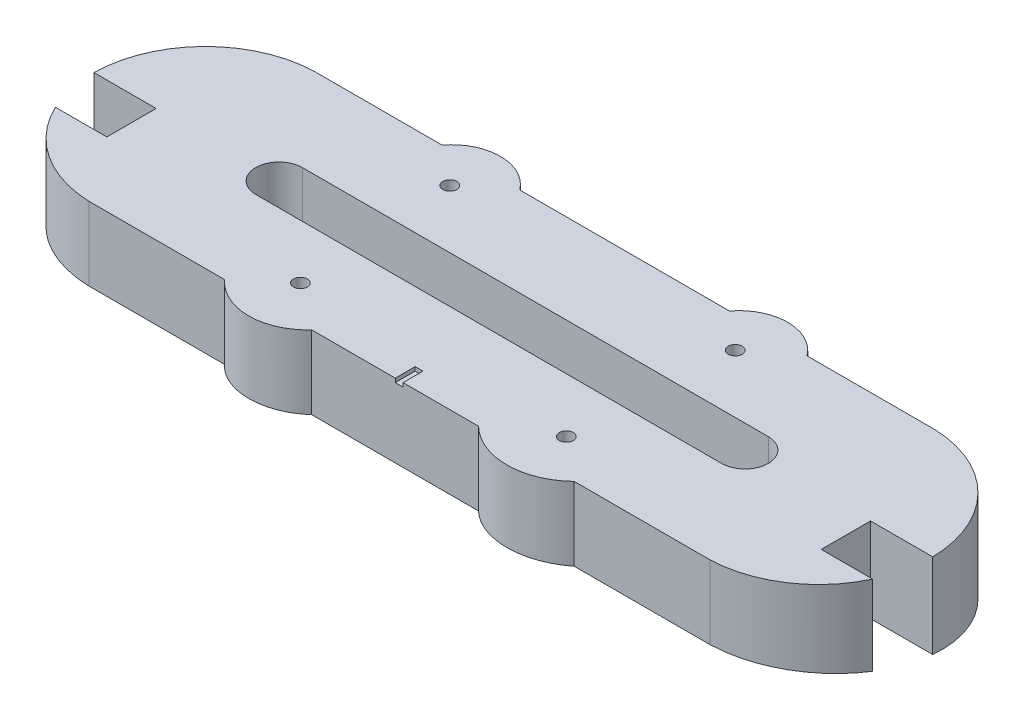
ISO-10303-21;
HEADER;
FILE_DESCRIPTION(('STEP AP214'),'2;1');
FILE_NAME('part.step','',(''),(''),'','','');
FILE_SCHEMA(('AUTOMOTIVE_DESIGN { 1 0 10303 214 1 1 1 1 }'));
ENDSEC;
DATA;
#1=APPLICATION_CONTEXT('core data for automotive mechanical design processes');
#2=APPLICATION_PROTOCOL_DEFINITION('international standard','automotive_design',2000,#1);
#3=PRODUCT_CONTEXT('',#1,'mechanical');
#4=PRODUCT('Part','Part','',(#3));
#5=PRODUCT_RELATED_PRODUCT_CATEGORY('part','',(#4));
#6=PRODUCT_DEFINITION_FORMATION('','',#4);
#7=PRODUCT_DEFINITION_CONTEXT('part definition',#1,'design');
#8=PRODUCT_DEFINITION('design','',#6,#7);
#9=PRODUCT_DEFINITION_SHAPE('','',#8);
#10=(LENGTH_UNIT() NAMED_UNIT(*) SI_UNIT(.MILLI.,.METRE.));
#11=(NAMED_UNIT(*) PLANE_ANGLE_UNIT() SI_UNIT($,.RADIAN.));
#12=(NAMED_UNIT(*) SI_UNIT($,.STERADIAN.) SOLID_ANGLE_UNIT());
#13=UNCERTAINTY_MEASURE_WITH_UNIT(LENGTH_MEASURE(1.E-05),#10,'distance_accuracy_value','');
#14=(GEOMETRIC_REPRESENTATION_CONTEXT(3) GLOBAL_UNCERTAINTY_ASSIGNED_CONTEXT((#13)) GLOBAL_UNIT_ASSIGNED_CONTEXT((#10,
#11,#12)) REPRESENTATION_CONTEXT('',''));
#15=CARTESIAN_POINT('',(0.,0.,0.));
#16=DIRECTION('',(0.,0.,1.));
#17=DIRECTION('',(1.,0.,0.));
#18=AXIS2_PLACEMENT_3D('',#15,#16,#17);
#19=CARTESIAN_POINT('',(0.,12.,0.));
#20=DIRECTION('',(0.,1.,0.));
#21=DIRECTION('',(0.,0.,1.));
#22=AXIS2_PLACEMENT_3D('',#19,#20,#21);
#23=PLANE('',#22);
#24=DIRECTION('',(0.,0.,1.));
#25=VECTOR('',#24,1.);
#26=CARTESIAN_POINT('',(5.70007725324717,12.,19.1306589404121));
#27=LINE('',#26,#25);
#28=CARTESIAN_POINT('',(5.70007725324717,12.,19.1306589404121));
#29=VERTEX_POINT('',#28);
#30=CARTESIAN_POINT('',(5.70007725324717,12.,24.2519083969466));
#31=VERTEX_POINT('',#30);
#32=EDGE_CURVE('E508',#29,#31,#27,.T.);
#33=ORIENTED_EDGE('',*,*,#32,.F.);
#34=DIRECTION('',(-1.,0.,0.));
#35=VECTOR('',#34,1.);
#36=CARTESIAN_POINT('',(5.70007725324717,12.,19.1306589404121));
#37=LINE('',#36,#35);
#38=CARTESIAN_POINT('',(7.70007725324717,12.,19.1306589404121));
#39=VERTEX_POINT('',#38);
#40=EDGE_CURVE('E513',#39,#29,#37,.T.);
#41=ORIENTED_EDGE('',*,*,#40,.F.);
#42=DIRECTION('',(0.,0.,-1.));
#43=VECTOR('',#42,1.);
#44=CARTESIAN_POINT('',(7.70007725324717,12.,19.1306589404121));
#45=LINE('',#44,#43);
#46=CARTESIAN_POINT('',(7.70007725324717,12.,24.2519083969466));
#47=VERTEX_POINT('',#46);
#48=EDGE_CURVE('E528',#47,#39,#45,.T.);
#49=ORIENTED_EDGE('',*,*,#48,.F.);
#50=DIRECTION('',(1.,0.,0.));
#51=VECTOR('',#50,1.);
#52=CARTESIAN_POINT('',(0.,12.,24.2519083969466));
#53=LINE('',#52,#51);
#54=CARTESIAN_POINT('',(27.1374386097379,12.,24.2519083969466));
#55=VERTEX_POINT('',#54);
#56=EDGE_CURVE('E406',#47,#55,#53,.T.);
#57=ORIENTED_EDGE('',*,*,#56,.T.);
#58=CARTESIAN_POINT('',(39.4488719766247,12.,11.5947692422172));
#59=DIRECTION('',(0.,1.,0.));
#60=DIRECTION('',(0.,0.,1.));
#61=AXIS2_PLACEMENT_3D('',#58,#59,#60);
#62=CIRCLE('',#61,17.6571391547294);
#63=CARTESIAN_POINT('',(51.7603053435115,12.,24.2519083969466));
#64=VERTEX_POINT('',#63);
#65=EDGE_CURVE('E402',#64,#55,#62,.F.);
#66=ORIENTED_EDGE('',*,*,#65,.F.);
#67=DIRECTION('',(-1.,0.,0.));
#68=VECTOR('',#67,1.);
#69=CARTESIAN_POINT('',(0.,12.,24.2519083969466));
#70=LINE('',#69,#68);
#71=CARTESIAN_POINT('',(86.7603053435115,12.,24.2519083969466));
#72=VERTEX_POINT('',#71);
#73=EDGE_CURVE('E382',#72,#64,#70,.T.);
#74=ORIENTED_EDGE('',*,*,#73,.F.);
#75=CARTESIAN_POINT('',(85.7424482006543,12.,-4.74809160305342));
#76=DIRECTION('',(0.,1.,0.));
#77=DIRECTION('',(0.,0.,1.));
#78=AXIS2_PLACEMENT_3D('',#75,#76,#77);
#79=CIRCLE('',#78,29.0178571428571);
#80=CARTESIAN_POINT('',(112.001037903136,12.,7.60190839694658));
#81=VERTEX_POINT('',#80);
#82=EDGE_CURVE('E386',#81,#72,#79,.F.);
#83=ORIENTED_EDGE('',*,*,#82,.F.);
#84=DIRECTION('',(1.,0.,0.));
#85=VECTOR('',#84,1.);
#86=CARTESIAN_POINT('',(130.760305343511,12.,7.60190839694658));
#87=LINE('',#86,#85);
#88=CARTESIAN_POINT('',(98.7603053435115,12.,7.60190839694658));
#89=VERTEX_POINT('',#88);
#90=EDGE_CURVE('E442',#89,#81,#87,.T.);
#91=ORIENTED_EDGE('',*,*,#90,.F.);
#92=DIRECTION('',(0.,0.,1.));
#93=VECTOR('',#92,1.);
#94=CARTESIAN_POINT('',(98.7603053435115,12.,-5.09809160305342));
#95=LINE('',#94,#93);
#96=CARTESIAN_POINT('',(98.7603053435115,12.,-5.09809160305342));
#97=VERTEX_POINT('',#96);
#98=EDGE_CURVE('E438',#97,#89,#95,.T.);
#99=ORIENTED_EDGE('',*,*,#98,.F.);
#100=DIRECTION('',(-1.,0.,0.));
#101=VECTOR('',#100,1.);
#102=CARTESIAN_POINT('',(130.760305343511,12.,-5.09809160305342));
#103=LINE('',#102,#101);
#104=CARTESIAN_POINT('',(114.758194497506,12.,-5.09809160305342));
#105=VERTEX_POINT('',#104);
#106=EDGE_CURVE('E433',#105,#97,#103,.T.);
#107=ORIENTED_EDGE('',*,*,#106,.F.);
#108=CARTESIAN_POINT('',(85.7424482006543,12.,-4.74809160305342));
#109=DIRECTION('',(0.,1.,0.));
#110=DIRECTION('',(0.,0.,1.));
#111=AXIS2_PLACEMENT_3D('',#108,#109,#110);
#112=CIRCLE('',#111,29.0178571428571);
#113=CARTESIAN_POINT('',(86.7603053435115,12.,-33.7480916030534));
#114=VERTEX_POINT('',#113);
#115=EDGE_CURVE('E337',#114,#105,#112,.F.);
#116=ORIENTED_EDGE('',*,*,#115,.F.);
#117=DIRECTION('',(1.,0.,0.));
#118=VECTOR('',#117,1.);
#119=CARTESIAN_POINT('',(0.,12.,-33.7480916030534));
#120=LINE('',#119,#118);
#121=CARTESIAN_POINT('',(53.7603053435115,12.,-33.7480916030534));
#122=VERTEX_POINT('',#121);
#123=EDGE_CURVE('E356',#122,#114,#120,.T.);
#124=ORIENTED_EDGE('',*,*,#123,.F.);
#125=CARTESIAN_POINT('',(43.7603053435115,12.,-26.2480916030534));
#126=DIRECTION('',(0.,1.,0.));
#127=DIRECTION('',(0.,0.,1.));
#128=AXIS2_PLACEMENT_3D('',#125,#126,#127);
#129=CIRCLE('',#128,12.5);
#130=CARTESIAN_POINT('',(33.7603053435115,12.,-33.7480916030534));
#131=VERTEX_POINT('',#130);
#132=EDGE_CURVE('E360',#122,#131,#129,.T.);
#133=ORIENTED_EDGE('',*,*,#132,.T.);
#134=DIRECTION('',(-1.,0.,0.));
#135=VECTOR('',#134,1.);
#136=CARTESIAN_POINT('',(0.,12.,-33.7480916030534));
#137=LINE('',#136,#135);
#138=CARTESIAN_POINT('',(-20.2396946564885,12.,-33.7480916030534));
#139=VERTEX_POINT('',#138);
#140=EDGE_CURVE('E585',#131,#139,#137,.T.);
#141=ORIENTED_EDGE('',*,*,#140,.T.);
#142=CARTESIAN_POINT('',(-30.2396946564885,12.,-26.2480916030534));
#143=DIRECTION('',(0.,1.,0.));
#144=DIRECTION('',(0.,0.,1.));
#145=AXIS2_PLACEMENT_3D('',#142,#143,#144);
#146=CIRCLE('',#145,12.5);
#147=CARTESIAN_POINT('',(-40.2396946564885,12.,-33.7480916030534));
#148=VERTEX_POINT('',#147);
#149=EDGE_CURVE('E341',#148,#139,#146,.F.);
#150=ORIENTED_EDGE('',*,*,#149,.F.);
#151=DIRECTION('',(-1.,0.,0.));
#152=VECTOR('',#151,1.);
#153=CARTESIAN_POINT('',(0.,12.,-33.7480916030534));
#154=LINE('',#153,#152);
#155=CARTESIAN_POINT('',(-73.2396946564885,12.,-33.7480916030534));
#156=VERTEX_POINT('',#155);
#157=EDGE_CURVE('E586',#148,#156,#154,.T.);
#158=ORIENTED_EDGE('',*,*,#157,.T.);
#159=CARTESIAN_POINT('',(-72.2218375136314,12.,-4.74809160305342));
#160=DIRECTION('',(0.,1.,0.));
#161=DIRECTION('',(0.,0.,1.));
#162=AXIS2_PLACEMENT_3D('',#159,#160,#161);
#163=CIRCLE('',#162,29.0178571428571);
#164=CARTESIAN_POINT('',(-101.237583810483,12.,-5.0980916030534));
#165=VERTEX_POINT('',#164);
#166=EDGE_CURVE('E575',#156,#165,#163,.T.);
#167=ORIENTED_EDGE('',*,*,#166,.T.);
#168=DIRECTION('',(-1.,0.,0.));
#169=VECTOR('',#168,1.);
#170=CARTESIAN_POINT('',(-117.239694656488,12.,-5.0980916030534));
#171=LINE('',#170,#169);
#172=CARTESIAN_POINT('',(-85.2396946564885,12.,-5.0980916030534));
#173=VERTEX_POINT('',#172);
#174=EDGE_CURVE('E425',#173,#165,#171,.T.);
#175=ORIENTED_EDGE('',*,*,#174,.F.);
#176=DIRECTION('',(0.,0.,-1.));
#177=VECTOR('',#176,1.);
#178=CARTESIAN_POINT('',(-85.2396946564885,12.,-5.0980916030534));
#179=LINE('',#178,#177);
#180=CARTESIAN_POINT('',(-85.2396946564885,12.,7.6019083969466));
#181=VERTEX_POINT('',#180);
#182=EDGE_CURVE('E421',#181,#173,#179,.T.);
#183=ORIENTED_EDGE('',*,*,#182,.F.);
#184=DIRECTION('',(1.,0.,0.));
#185=VECTOR('',#184,1.);
#186=CARTESIAN_POINT('',(-117.239694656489,12.,7.6019083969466));
#187=LINE('',#186,#185);
#188=CARTESIAN_POINT('',(-98.4804272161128,12.,7.6019083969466));
#189=VERTEX_POINT('',#188);
#190=EDGE_CURVE('E415',#189,#181,#187,.T.);
#191=ORIENTED_EDGE('',*,*,#190,.F.);
#192=CARTESIAN_POINT('',(-72.2218375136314,12.,-4.74809160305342));
#193=DIRECTION('',(0.,1.,0.));
#194=DIRECTION('',(0.,0.,1.));
#195=AXIS2_PLACEMENT_3D('',#192,#193,#194);
#196=CIRCLE('',#195,29.0178571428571);
#197=CARTESIAN_POINT('',(-73.2396946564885,12.,24.2519083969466));
#198=VERTEX_POINT('',#197);
#199=EDGE_CURVE('E364',#189,#198,#196,.T.);
#200=ORIENTED_EDGE('',*,*,#199,.T.);
#201=DIRECTION('',(1.,0.,0.));
#202=VECTOR('',#201,1.);
#203=CARTESIAN_POINT('',(0.,12.,24.2519083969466));
#204=LINE('',#203,#202);
#205=CARTESIAN_POINT('',(-38.2396946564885,12.,24.2519083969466));
#206=VERTEX_POINT('',#205);
#207=EDGE_CURVE('E369',#198,#206,#204,.T.);
#208=ORIENTED_EDGE('',*,*,#207,.T.);
#209=CARTESIAN_POINT('',(-27.0511280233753,12.,14.2335060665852));
#210=DIRECTION('',(0.,1.,0.));
#211=DIRECTION('',(0.,0.,1.));
#212=AXIS2_PLACEMENT_3D('',#209,#210,#211);
#213=CIRCLE('',#212,15.0184023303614);
#214=CARTESIAN_POINT('',(-15.8625613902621,12.,24.2519083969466));
#215=VERTEX_POINT('',#214);
#216=EDGE_CURVE('E391',#206,#215,#213,.T.);
#217=ORIENTED_EDGE('',*,*,#216,.T.);
#218=EDGE_CURVE('E407',#215,#31,#53,.T.);
#219=ORIENTED_EDGE('',*,*,#218,.T.);
#220=EDGE_LOOP('',(#33,#41,#49,#57,#66,#74,#83,#91,#99,#107,#116,#124,#133,#141,#150,#158,#167,
#175,#183,#191,#200,#208,#217,#219));
#221=FACE_BOUND('',#220,.T.);
#222=CARTESIAN_POINT('',(-30.2396946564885,12.,-25.7480916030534));
#223=DIRECTION('',(0.,1.,0.));
#224=DIRECTION('',(0.,0.,1.));
#225=AXIS2_PLACEMENT_3D('',#222,#223,#224);
#226=CIRCLE('',#225,1.8);
#227=CARTESIAN_POINT('',(-30.2396946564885,12.,-23.9480916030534));
#228=VERTEX_POINT('',#227);
#229=EDGE_CURVE('E538',#228,#228,#226,.T.);
#230=ORIENTED_EDGE('',*,*,#229,.F.);
#231=EDGE_LOOP('',(#230));
#232=FACE_BOUND('',#231,.T.);
#233=CARTESIAN_POINT('',(43.2603053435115,12.,-25.7480916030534));
#234=DIRECTION('',(0.,1.,0.));
#235=DIRECTION('',(0.,0.,1.));
#236=AXIS2_PLACEMENT_3D('',#233,#234,#235);
#237=CIRCLE('',#236,1.79999999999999);
#238=CARTESIAN_POINT('',(43.2603053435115,12.,-23.9480916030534));
#239=VERTEX_POINT('',#238);
#240=EDGE_CURVE('E551',#239,#239,#237,.T.);
#241=ORIENTED_EDGE('',*,*,#240,.F.);
#242=EDGE_LOOP('',(#241));
#243=FACE_BOUND('',#242,.T.);
#244=CARTESIAN_POINT('',(40.7603053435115,12.,15.2519083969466));
#245=DIRECTION('',(0.,1.,0.));
#246=DIRECTION('',(0.,0.,1.));
#247=AXIS2_PLACEMENT_3D('',#244,#245,#246);
#248=CIRCLE('',#247,1.8);
#249=CARTESIAN_POINT('',(40.7603053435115,12.,17.0519083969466));
#250=VERTEX_POINT('',#249);
#251=EDGE_CURVE('E559',#250,#250,#248,.T.);
#252=ORIENTED_EDGE('',*,*,#251,.F.);
#253=EDGE_LOOP('',(#252));
#254=FACE_BOUND('',#253,.T.);
#255=CARTESIAN_POINT('',(-27.7396946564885,12.,15.2519083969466));
#256=DIRECTION('',(0.,1.,0.));
#257=DIRECTION('',(0.,0.,1.));
#258=AXIS2_PLACEMENT_3D('',#255,#256,#257);
#259=CIRCLE('',#258,1.8);
#260=CARTESIAN_POINT('',(-27.7396946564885,12.,17.0519083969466));
#261=VERTEX_POINT('',#260);
#262=EDGE_CURVE('E567',#261,#261,#259,.T.);
#263=ORIENTED_EDGE('',*,*,#262,.F.);
#264=EDGE_LOOP('',(#263));
#265=FACE_BOUND('',#264,.T.);
#266=CARTESIAN_POINT('',(-53.2396946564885,12.,-4.74809160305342));
#267=DIRECTION('',(0.,1.,0.));
#268=DIRECTION('',(0.,0.,1.));
#269=AXIS2_PLACEMENT_3D('',#266,#267,#268);
#270=CIRCLE('',#269,6.);
#271=CARTESIAN_POINT('',(-53.2396946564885,12.,-10.7480916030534));
#272=VERTEX_POINT('',#271);
#273=CARTESIAN_POINT('',(-53.2396946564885,12.,1.25190839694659));
#274=VERTEX_POINT('',#273);
#275=EDGE_CURVE('E449',#272,#274,#270,.T.);
#276=ORIENTED_EDGE('',*,*,#275,.F.);
#277=DIRECTION('',(-1.,0.,0.));
#278=VECTOR('',#277,1.);
#279=CARTESIAN_POINT('',(-53.2396946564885,12.,-10.7480916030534));
#280=LINE('',#279,#278);
#281=CARTESIAN_POINT('',(66.7603053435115,12.,-10.7480916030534));
#282=VERTEX_POINT('',#281);
#283=EDGE_CURVE('E463',#282,#272,#280,.T.);
#284=ORIENTED_EDGE('',*,*,#283,.F.);
#285=CARTESIAN_POINT('',(66.7603053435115,12.,-4.74809160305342));
#286=DIRECTION('',(0.,1.,0.));
#287=DIRECTION('',(0.,0.,1.));
#288=AXIS2_PLACEMENT_3D('',#285,#286,#287);
#289=CIRCLE('',#288,6.);
#290=CARTESIAN_POINT('',(66.7603053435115,12.,1.25190839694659));
#291=VERTEX_POINT('',#290);
#292=EDGE_CURVE('E459',#291,#282,#289,.T.);
#293=ORIENTED_EDGE('',*,*,#292,.F.);
#294=DIRECTION('',(1.,0.,0.));
#295=VECTOR('',#294,1.);
#296=CARTESIAN_POINT('',(-53.2396946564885,12.,1.25190839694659));
#297=LINE('',#296,#295);
#298=EDGE_CURVE('E455',#274,#291,#297,.T.);
#299=ORIENTED_EDGE('',*,*,#298,.F.);
#300=EDGE_LOOP('',(#276,#284,#293,#299));
#301=FACE_BOUND('',#300,.T.);
#302=ADVANCED_FACE('F129',(#221,#232,#243,#254,#265,#301),#23,.T.);
#303=CARTESIAN_POINT('',(-117.239694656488,0.,-5.0980916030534));
#304=DIRECTION('',(0.,0.,-1.));
#305=DIRECTION('',(-1.,0.,0.));
#306=AXIS2_PLACEMENT_3D('',#303,#304,#305);
#307=PLANE('',#306);
#308=DIRECTION('',(0.,1.,0.));
#309=VECTOR('',#308,1.);
#310=CARTESIAN_POINT('',(-101.237583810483,0.,-5.0980916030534));
#311=LINE('',#310,#309);
#312=CARTESIAN_POINT('',(-101.237583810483,-9.80774603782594,-5.09809160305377));
#313=VERTEX_POINT('',#312);
#314=EDGE_CURVE('E581',#313,#165,#311,.T.);
#315=ORIENTED_EDGE('',*,*,#314,.F.);
#316=DIRECTION('',(1.,0.,0.));
#317=VECTOR('',#316,1.);
#318=CARTESIAN_POINT('',(-117.239694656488,-9.80774603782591,-5.0980916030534));
#319=LINE('',#318,#317);
#320=CARTESIAN_POINT('',(-85.2396946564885,-9.80774603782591,-5.0980916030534));
#321=VERTEX_POINT('',#320);
#322=EDGE_CURVE('E691',#313,#321,#319,.T.);
#323=ORIENTED_EDGE('',*,*,#322,.T.);
#324=DIRECTION('',(0.,1.,0.));
#325=VECTOR('',#324,1.);
#326=CARTESIAN_POINT('',(-85.2396946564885,0.,-5.0980916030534));
#327=LINE('',#326,#325);
#328=EDGE_CURVE('E430',#321,#173,#327,.T.);
#329=ORIENTED_EDGE('',*,*,#328,.T.);
#330=ORIENTED_EDGE('',*,*,#174,.T.);
#331=EDGE_LOOP('',(#315,#323,#329,#330));
#332=FACE_BOUND('',#331,.T.);
#333=ADVANCED_FACE('F728',(#332),#307,.F.);
#334=CARTESIAN_POINT('',(-117.239694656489,0.,7.6019083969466));
#335=DIRECTION('',(0.,0.,1.));
#336=DIRECTION('',(1.,0.,0.));
#337=AXIS2_PLACEMENT_3D('',#334,#335,#336);
#338=PLANE('',#337);
#339=DIRECTION('',(0.,1.,0.));
#340=VECTOR('',#339,1.);
#341=CARTESIAN_POINT('',(-85.2396946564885,0.,7.6019083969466));
#342=LINE('',#341,#340);
#343=CARTESIAN_POINT('',(-85.2396946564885,-8.55802424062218,7.60190839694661));
#344=VERTEX_POINT('',#343);
#345=EDGE_CURVE('E429',#344,#181,#342,.T.);
#346=ORIENTED_EDGE('',*,*,#345,.F.);
#347=DIRECTION('',(-1.,0.,0.));
#348=VECTOR('',#347,1.);
#349=CARTESIAN_POINT('',(-117.239694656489,-8.55802424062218,7.6019083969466));
#350=LINE('',#349,#348);
#351=CARTESIAN_POINT('',(-98.4804272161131,-8.55802424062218,7.6019083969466));
#352=VERTEX_POINT('',#351);
#353=EDGE_CURVE('E678',#344,#352,#350,.T.);
#354=ORIENTED_EDGE('',*,*,#353,.T.);
#355=DIRECTION('',(0.,1.,0.));
#356=VECTOR('',#355,1.);
#357=CARTESIAN_POINT('',(-98.4804272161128,0.,7.6019083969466));
#358=LINE('',#357,#356);
#359=EDGE_CURVE('E368',#352,#189,#358,.T.);
#360=ORIENTED_EDGE('',*,*,#359,.T.);
#361=ORIENTED_EDGE('',*,*,#190,.T.);
#362=EDGE_LOOP('',(#346,#354,#360,#361));
#363=FACE_BOUND('',#362,.T.);
#364=ADVANCED_FACE('F732',(#363),#338,.F.);
#365=CARTESIAN_POINT('',(-53.2396946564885,0.,-4.74809160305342));
#366=DIRECTION('',(0.,1.,0.));
#367=DIRECTION('',(0.,0.,1.));
#368=AXIS2_PLACEMENT_3D('',#365,#366,#367);
#369=CYLINDRICAL_SURFACE('',#368,6.);
#370=DIRECTION('',(0.,1.,0.));
#371=VECTOR('',#370,1.);
#372=CARTESIAN_POINT('',(-53.2396946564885,0.,1.25190839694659));
#373=LINE('',#372,#371);
#374=CARTESIAN_POINT('',(-53.2396946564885,-9.18288513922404,1.25190839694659));
#375=VERTEX_POINT('',#374);
#376=EDGE_CURVE('E467',#375,#274,#373,.T.);
#377=ORIENTED_EDGE('',*,*,#376,.F.);
#378=CARTESIAN_POINT('',(-53.2396946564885,-9.77330488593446,-4.74809160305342));
#379=DIRECTION('',(0.,0.995193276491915,-0.0979302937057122));
#380=DIRECTION('',(0.,0.0979302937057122,0.995193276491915));
#381=AXIS2_PLACEMENT_3D('',#378,#379,#380);
#382=ELLIPSE('',#381,6.0289796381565,6.);
#383=CARTESIAN_POINT('',(-53.2396946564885,-10.3637246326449,-10.7480916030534));
#384=VERTEX_POINT('',#383);
#385=EDGE_CURVE('E144',#375,#384,#382,.F.);
#386=ORIENTED_EDGE('',*,*,#385,.T.);
#387=DIRECTION('',(0.,1.,0.));
#388=VECTOR('',#387,1.);
#389=CARTESIAN_POINT('',(-53.2396946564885,0.,-10.7480916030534));
#390=LINE('',#389,#388);
#391=EDGE_CURVE('E137',#384,#272,#390,.T.);
#392=ORIENTED_EDGE('',*,*,#391,.T.);
#393=ORIENTED_EDGE('',*,*,#275,.T.);
#394=EDGE_LOOP('',(#377,#386,#392,#393));
#395=FACE_BOUND('',#394,.T.);
#396=ADVANCED_FACE('F485',(#395),#369,.F.);
#397=CARTESIAN_POINT('',(-53.2396946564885,0.,-10.7480916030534));
#398=DIRECTION('',(0.,0.,-1.));
#399=DIRECTION('',(-1.,0.,0.));
#400=AXIS2_PLACEMENT_3D('',#397,#398,#399);
#401=PLANE('',#400);
#402=ORIENTED_EDGE('',*,*,#391,.F.);
#403=DIRECTION('',(1.,0.,0.));
#404=VECTOR('',#403,1.);
#405=CARTESIAN_POINT('',(-53.2396946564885,-10.3637246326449,-10.7480916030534));
#406=LINE('',#405,#404);
#407=CARTESIAN_POINT('',(66.7603053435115,-10.3637246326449,-10.7480916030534));
#408=VERTEX_POINT('',#407);
#409=EDGE_CURVE('E496',#384,#408,#406,.T.);
#410=ORIENTED_EDGE('',*,*,#409,.T.);
#411=DIRECTION('',(0.,1.,0.));
#412=VECTOR('',#411,1.);
#413=CARTESIAN_POINT('',(66.7603053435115,0.,-10.7480916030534));
#414=LINE('',#413,#412);
#415=EDGE_CURVE('E470',#408,#282,#414,.T.);
#416=ORIENTED_EDGE('',*,*,#415,.T.);
#417=ORIENTED_EDGE('',*,*,#283,.T.);
#418=EDGE_LOOP('',(#402,#410,#416,#417));
#419=FACE_BOUND('',#418,.T.);
#420=ADVANCED_FACE('F752',(#419),#401,.F.);
#421=CARTESIAN_POINT('',(66.7603053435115,0.,-4.74809160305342));
#422=DIRECTION('',(0.,1.,0.));
#423=DIRECTION('',(0.,0.,1.));
#424=AXIS2_PLACEMENT_3D('',#421,#422,#423);
#425=CYLINDRICAL_SURFACE('',#424,6.);
#426=ORIENTED_EDGE('',*,*,#415,.F.);
#427=CARTESIAN_POINT('',(66.7603053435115,-9.77330488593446,-4.74809160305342));
#428=DIRECTION('',(0.,0.995193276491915,-0.0979302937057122));
#429=DIRECTION('',(0.,0.0979302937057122,0.995193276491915));
#430=AXIS2_PLACEMENT_3D('',#427,#428,#429);
#431=ELLIPSE('',#430,6.0289796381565,6.);
#432=CARTESIAN_POINT('',(66.7603053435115,-9.18288513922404,1.25190839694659));
#433=VERTEX_POINT('',#432);
#434=EDGE_CURVE('E493',#408,#433,#431,.F.);
#435=ORIENTED_EDGE('',*,*,#434,.T.);
#436=DIRECTION('',(0.,1.,0.));
#437=VECTOR('',#436,1.);
#438=CARTESIAN_POINT('',(66.7603053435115,0.,1.25190839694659));
#439=LINE('',#438,#437);
#440=EDGE_CURVE('E473',#433,#291,#439,.T.);
#441=ORIENTED_EDGE('',*,*,#440,.T.);
#442=ORIENTED_EDGE('',*,*,#292,.T.);
#443=EDGE_LOOP('',(#426,#435,#441,#442));
#444=FACE_BOUND('',#443,.T.);
#445=ADVANCED_FACE('F491',(#444),#425,.F.);
#446=CARTESIAN_POINT('',(-53.2396946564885,0.,1.25190839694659));
#447=DIRECTION('',(0.,0.,1.));
#448=DIRECTION('',(1.,0.,0.));
#449=AXIS2_PLACEMENT_3D('',#446,#447,#448);
#450=PLANE('',#449);
#451=ORIENTED_EDGE('',*,*,#440,.F.);
#452=DIRECTION('',(-1.,0.,0.));
#453=VECTOR('',#452,1.);
#454=CARTESIAN_POINT('',(-53.2396946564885,-9.18288513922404,1.25190839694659));
#455=LINE('',#454,#453);
#456=EDGE_CURVE('E482',#433,#375,#455,.T.);
#457=ORIENTED_EDGE('',*,*,#456,.T.);
#458=ORIENTED_EDGE('',*,*,#376,.T.);
#459=ORIENTED_EDGE('',*,*,#298,.T.);
#460=EDGE_LOOP('',(#451,#457,#458,#459));
#461=FACE_BOUND('',#460,.T.);
#462=ADVANCED_FACE('F479',(#461),#450,.F.);
#463=CARTESIAN_POINT('',(130.760305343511,0.,7.60190839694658));
#464=DIRECTION('',(0.,0.,1.));
#465=DIRECTION('',(1.,0.,0.));
#466=AXIS2_PLACEMENT_3D('',#463,#464,#465);
#467=PLANE('',#466);
#468=DIRECTION('',(0.,1.,0.));
#469=VECTOR('',#468,1.);
#470=CARTESIAN_POINT('',(112.001037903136,0.,7.60190839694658));
#471=LINE('',#470,#469);
#472=CARTESIAN_POINT('',(112.001037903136,-8.55802424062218,7.60190839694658));
#473=VERTEX_POINT('',#472);
#474=EDGE_CURVE('E387',#473,#81,#471,.T.);
#475=ORIENTED_EDGE('',*,*,#474,.F.);
#476=DIRECTION('',(-1.,0.,0.));
#477=VECTOR('',#476,1.);
#478=CARTESIAN_POINT('',(130.760305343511,-8.55802424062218,7.60190839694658));
#479=LINE('',#478,#477);
#480=CARTESIAN_POINT('',(98.7603053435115,-8.55802424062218,7.60190839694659));
#481=VERTEX_POINT('',#480);
#482=EDGE_CURVE('E625',#473,#481,#479,.T.);
#483=ORIENTED_EDGE('',*,*,#482,.T.);
#484=DIRECTION('',(0.,1.,0.));
#485=VECTOR('',#484,1.);
#486=CARTESIAN_POINT('',(98.7603053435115,0.,7.60190839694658));
#487=LINE('',#486,#485);
#488=EDGE_CURVE('E446',#481,#89,#487,.T.);
#489=ORIENTED_EDGE('',*,*,#488,.T.);
#490=ORIENTED_EDGE('',*,*,#90,.T.);
#491=EDGE_LOOP('',(#475,#483,#489,#490));
#492=FACE_BOUND('',#491,.T.);
#493=ADVANCED_FACE('F714',(#492),#467,.F.);
#494=CARTESIAN_POINT('',(130.760305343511,0.,-5.09809160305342));
#495=DIRECTION('',(0.,0.,-1.));
#496=DIRECTION('',(-1.,0.,0.));
#497=AXIS2_PLACEMENT_3D('',#494,#495,#496);
#498=PLANE('',#497);
#499=DIRECTION('',(0.,1.,0.));
#500=VECTOR('',#499,1.);
#501=CARTESIAN_POINT('',(98.7603053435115,0.,-5.09809160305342));
#502=LINE('',#501,#500);
#503=CARTESIAN_POINT('',(98.7603053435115,-9.80774603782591,-5.09809160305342));
#504=VERTEX_POINT('',#503);
#505=EDGE_CURVE('E331',#504,#97,#502,.T.);
#506=ORIENTED_EDGE('',*,*,#505,.F.);
#507=DIRECTION('',(1.,0.,0.));
#508=VECTOR('',#507,1.);
#509=CARTESIAN_POINT('',(130.760305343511,-9.80774603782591,-5.09809160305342));
#510=LINE('',#509,#508);
#511=CARTESIAN_POINT('',(114.758194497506,-9.80774603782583,-5.09809160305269));
#512=VERTEX_POINT('',#511);
#513=EDGE_CURVE('E315',#504,#512,#510,.T.);
#514=ORIENTED_EDGE('',*,*,#513,.T.);
#515=DIRECTION('',(0.,1.,0.));
#516=VECTOR('',#515,1.);
#517=CARTESIAN_POINT('',(114.758194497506,0.,-5.09809160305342));
#518=LINE('',#517,#516);
#519=EDGE_CURVE('E329',#512,#105,#518,.T.);
#520=ORIENTED_EDGE('',*,*,#519,.T.);
#521=ORIENTED_EDGE('',*,*,#106,.T.);
#522=EDGE_LOOP('',(#506,#514,#520,#521));
#523=FACE_BOUND('',#522,.T.);
#524=ADVANCED_FACE('F327',(#523),#498,.F.);
#525=CARTESIAN_POINT('',(98.7603053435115,0.,-5.09809160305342));
#526=DIRECTION('',(-1.,0.,0.));
#527=DIRECTION('',(0.,0.,1.));
#528=AXIS2_PLACEMENT_3D('',#525,#526,#527);
#529=PLANE('',#528);
#530=ORIENTED_EDGE('',*,*,#488,.F.);
#531=DIRECTION('',(0.,-0.0979302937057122,-0.995193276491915));
#532=VECTOR('',#531,1.);
#533=CARTESIAN_POINT('',(98.7603053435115,-9.7136863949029,-4.14223289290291));
#534=LINE('',#533,#532);
#535=EDGE_CURVE('E622',#481,#504,#534,.T.);
#536=ORIENTED_EDGE('',*,*,#535,.T.);
#537=ORIENTED_EDGE('',*,*,#505,.T.);
#538=ORIENTED_EDGE('',*,*,#98,.T.);
#539=EDGE_LOOP('',(#530,#536,#537,#538));
#540=FACE_BOUND('',#539,.T.);
#541=ADVANCED_FACE('F621',(#540),#529,.F.);
#542=CARTESIAN_POINT('',(-85.2396946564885,0.,-5.0980916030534));
#543=DIRECTION('',(1.,0.,0.));
#544=DIRECTION('',(0.,0.,-1.));
#545=AXIS2_PLACEMENT_3D('',#542,#543,#544);
#546=PLANE('',#545);
#547=ORIENTED_EDGE('',*,*,#328,.F.);
#548=DIRECTION('',(0.,0.0979302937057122,0.995193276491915));
#549=VECTOR('',#548,1.);
#550=CARTESIAN_POINT('',(-85.2396946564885,-9.7136863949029,-4.14223289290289));
#551=LINE('',#550,#549);
#552=EDGE_CURVE('E680',#321,#344,#551,.T.);
#553=ORIENTED_EDGE('',*,*,#552,.T.);
#554=ORIENTED_EDGE('',*,*,#345,.T.);
#555=ORIENTED_EDGE('',*,*,#182,.T.);
#556=EDGE_LOOP('',(#547,#553,#554,#555));
#557=FACE_BOUND('',#556,.T.);
#558=ADVANCED_FACE('F725',(#557),#546,.F.);
#559=CARTESIAN_POINT('',(-27.0511280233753,0.,14.2335060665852));
#560=DIRECTION('',(0.,1.,0.));
#561=DIRECTION('',(0.,0.,1.));
#562=AXIS2_PLACEMENT_3D('',#559,#560,#561);
#563=CYLINDRICAL_SURFACE('',#562,15.0184023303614);
#564=DIRECTION('',(0.,1.,0.));
#565=VECTOR('',#564,1.);
#566=CARTESIAN_POINT('',(-38.2396946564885,0.,24.2519083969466));
#567=LINE('',#566,#565);
#568=CARTESIAN_POINT('',(-38.2396946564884,-6.91960944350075,24.2519083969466));
#569=VERTEX_POINT('',#568);
#570=EDGE_CURVE('E376',#569,#206,#567,.T.);
#571=ORIENTED_EDGE('',*,*,#570,.F.);
#572=CARTESIAN_POINT('',(-27.0511280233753,-7.9054532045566,14.2335060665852));
#573=DIRECTION('',(0.,0.995193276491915,-0.0979302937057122));
#574=DIRECTION('',(0.,0.0979302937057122,0.995193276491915));
#575=AXIS2_PLACEMENT_3D('',#572,#573,#574);
#576=ELLIPSE('',#575,15.0909403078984,15.0184023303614);
#577=CARTESIAN_POINT('',(-15.8625613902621,-6.91960944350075,24.2519083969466));
#578=VERTEX_POINT('',#577);
#579=EDGE_CURVE('E633',#578,#569,#576,.F.);
#580=ORIENTED_EDGE('',*,*,#579,.F.);
#581=DIRECTION('',(0.,1.,0.));
#582=VECTOR('',#581,1.);
#583=CARTESIAN_POINT('',(-15.8625613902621,0.,24.2519083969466));
#584=LINE('',#583,#582);
#585=EDGE_CURVE('E412',#578,#215,#584,.T.);
#586=ORIENTED_EDGE('',*,*,#585,.T.);
#587=ORIENTED_EDGE('',*,*,#216,.F.);
#588=EDGE_LOOP('',(#571,#580,#586,#587));
#589=FACE_BOUND('',#588,.T.);
#590=ADVANCED_FACE('F655',(#589),#563,.T.);
#591=CARTESIAN_POINT('',(0.,0.,24.2519083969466));
#592=DIRECTION('',(0.,0.,1.));
#593=DIRECTION('',(1.,0.,0.));
#594=AXIS2_PLACEMENT_3D('',#591,#592,#593);
#595=PLANE('',#594);
#596=DIRECTION('',(-1.,0.,0.));
#597=VECTOR('',#596,1.);
#598=CARTESIAN_POINT('',(0.,-6.91960944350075,24.2519083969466));
#599=LINE('',#598,#597);
#600=CARTESIAN_POINT('',(27.1374386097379,-6.91960944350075,24.2519083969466));
#601=VERTEX_POINT('',#600);
#602=EDGE_CURVE('E502',#601,#578,#599,.T.);
#603=ORIENTED_EDGE('',*,*,#602,.F.);
#604=DIRECTION('',(0.,1.,0.));
#605=VECTOR('',#604,1.);
#606=CARTESIAN_POINT('',(27.1374386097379,0.,24.2519083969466));
#607=LINE('',#606,#605);
#608=EDGE_CURVE('E411',#601,#55,#607,.T.);
#609=ORIENTED_EDGE('',*,*,#608,.T.);
#610=ORIENTED_EDGE('',*,*,#56,.F.);
#611=DIRECTION('',(0.,1.,0.));
#612=VECTOR('',#611,1.);
#613=CARTESIAN_POINT('',(7.70007725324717,11.,24.2519083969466));
#614=LINE('',#613,#612);
#615=CARTESIAN_POINT('',(7.70007725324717,11.,24.2519083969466));
#616=VERTEX_POINT('',#615);
#617=EDGE_CURVE('E542',#616,#47,#614,.T.);
#618=ORIENTED_EDGE('',*,*,#617,.F.);
#619=DIRECTION('',(1.,0.,0.));
#620=VECTOR('',#619,1.);
#621=CARTESIAN_POINT('',(5.70007725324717,11.,24.2519083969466));
#622=LINE('',#621,#620);
#623=CARTESIAN_POINT('',(5.70007725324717,11.,24.2519083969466));
#624=VERTEX_POINT('',#623);
#625=EDGE_CURVE('E512',#624,#616,#622,.T.);
#626=ORIENTED_EDGE('',*,*,#625,.F.);
#627=DIRECTION('',(0.,1.,0.));
#628=VECTOR('',#627,1.);
#629=CARTESIAN_POINT('',(5.70007725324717,11.,24.2519083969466));
#630=LINE('',#629,#628);
#631=EDGE_CURVE('E525',#624,#31,#630,.T.);
#632=ORIENTED_EDGE('',*,*,#631,.T.);
#633=ORIENTED_EDGE('',*,*,#218,.F.);
#634=ORIENTED_EDGE('',*,*,#585,.F.);
#635=EDGE_LOOP('',(#603,#609,#610,#618,#626,#632,#633,#634));
#636=FACE_BOUND('',#635,.T.);
#637=ADVANCED_FACE('F659',(#636),#595,.T.);
#638=CARTESIAN_POINT('',(39.4488719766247,0.,11.5947692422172));
#639=DIRECTION('',(0.,1.,0.));
#640=DIRECTION('',(0.,0.,1.));
#641=AXIS2_PLACEMENT_3D('',#638,#639,#640);
#642=CYLINDRICAL_SURFACE('',#641,17.6571391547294);
#643=CARTESIAN_POINT('',(39.4488719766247,-8.16511359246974,11.5947692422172));
#644=DIRECTION('',(0.,0.995193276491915,-0.0979302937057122));
#645=DIRECTION('',(0.,0.0979302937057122,0.995193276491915));
#646=AXIS2_PLACEMENT_3D('',#643,#644,#645);
#647=ELLIPSE('',#646,17.7424220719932,17.6571391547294);
#648=CARTESIAN_POINT('',(51.7603053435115,-6.91960944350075,24.2519083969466));
#649=VERTEX_POINT('',#648);
#650=EDGE_CURVE('E642',#601,#649,#647,.T.);
#651=ORIENTED_EDGE('',*,*,#650,.T.);
#652=DIRECTION('',(0.,1.,0.));
#653=VECTOR('',#652,1.);
#654=CARTESIAN_POINT('',(51.7603053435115,0.,24.2519083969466));
#655=LINE('',#654,#653);
#656=EDGE_CURVE('E379',#649,#64,#655,.T.);
#657=ORIENTED_EDGE('',*,*,#656,.T.);
#658=ORIENTED_EDGE('',*,*,#65,.T.);
#659=ORIENTED_EDGE('',*,*,#608,.F.);
#660=EDGE_LOOP('',(#651,#657,#658,#659));
#661=FACE_BOUND('',#660,.T.);
#662=ADVANCED_FACE('F706',(#661),#642,.T.);
#663=CARTESIAN_POINT('',(0.,0.,24.2519083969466));
#664=DIRECTION('',(0.,0.,-1.));
#665=DIRECTION('',(-1.,0.,0.));
#666=AXIS2_PLACEMENT_3D('',#663,#664,#665);
#667=PLANE('',#666);
#668=ORIENTED_EDGE('',*,*,#656,.F.);
#669=DIRECTION('',(1.,0.,0.));
#670=VECTOR('',#669,1.);
#671=CARTESIAN_POINT('',(0.,-6.91960944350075,24.2519083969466));
#672=LINE('',#671,#670);
#673=CARTESIAN_POINT('',(86.7603053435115,-6.91960944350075,24.2519083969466));
#674=VERTEX_POINT('',#673);
#675=EDGE_CURVE('E638',#649,#674,#672,.T.);
#676=ORIENTED_EDGE('',*,*,#675,.T.);
#677=DIRECTION('',(0.,1.,0.));
#678=VECTOR('',#677,1.);
#679=CARTESIAN_POINT('',(86.7603053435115,0.,24.2519083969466));
#680=LINE('',#679,#678);
#681=EDGE_CURVE('E392',#674,#72,#680,.T.);
#682=ORIENTED_EDGE('',*,*,#681,.T.);
#683=ORIENTED_EDGE('',*,*,#73,.T.);
#684=EDGE_LOOP('',(#668,#676,#682,#683));
#685=FACE_BOUND('',#684,.T.);
#686=ADVANCED_FACE('F709',(#685),#667,.F.);
#687=CARTESIAN_POINT('',(85.7424482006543,0.,-4.74809160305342));
#688=DIRECTION('',(0.,1.,0.));
#689=DIRECTION('',(0.,0.,1.));
#690=AXIS2_PLACEMENT_3D('',#687,#688,#689);
#691=CYLINDRICAL_SURFACE('',#690,29.0178571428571);
#692=ORIENTED_EDGE('',*,*,#681,.F.);
#693=CARTESIAN_POINT('',(85.7424482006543,-9.77330488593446,-4.74809160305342));
#694=DIRECTION('',(0.,0.995193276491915,-0.0979302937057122));
#695=DIRECTION('',(0.,0.0979302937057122,0.995193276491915));
#696=AXIS2_PLACEMENT_3D('',#693,#694,#695);
#697=ELLIPSE('',#696,29.1580116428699,29.0178571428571);
#698=EDGE_CURVE('E628',#674,#473,#697,.T.);
#699=ORIENTED_EDGE('',*,*,#698,.T.);
#700=ORIENTED_EDGE('',*,*,#474,.T.);
#701=ORIENTED_EDGE('',*,*,#82,.T.);
#702=EDGE_LOOP('',(#692,#699,#700,#701));
#703=FACE_BOUND('',#702,.T.);
#704=ADVANCED_FACE('F715',(#703),#691,.T.);
#705=CARTESIAN_POINT('',(-72.2218375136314,0.,-4.74809160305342));
#706=DIRECTION('',(0.,1.,0.));
#707=DIRECTION('',(0.,0.,1.));
#708=AXIS2_PLACEMENT_3D('',#705,#706,#707);
#709=CYLINDRICAL_SURFACE('',#708,29.0178571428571);
#710=CARTESIAN_POINT('',(-72.2218375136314,-9.77330488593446,-4.74809160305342));
#711=DIRECTION('',(0.,0.995193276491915,-0.0979302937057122));
#712=DIRECTION('',(0.,0.0979302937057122,0.995193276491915));
#713=AXIS2_PLACEMENT_3D('',#710,#711,#712);
#714=ELLIPSE('',#713,29.1580116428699,29.0178571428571);
#715=CARTESIAN_POINT('',(-73.2396946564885,-6.91960944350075,24.2519083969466));
#716=VERTEX_POINT('',#715);
#717=EDGE_CURVE('E323',#716,#352,#714,.F.);
#718=ORIENTED_EDGE('',*,*,#717,.F.);
#719=DIRECTION('',(0.,1.,0.));
#720=VECTOR('',#719,1.);
#721=CARTESIAN_POINT('',(-73.2396946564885,0.,24.2519083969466));
#722=LINE('',#721,#720);
#723=EDGE_CURVE('E373',#716,#198,#722,.T.);
#724=ORIENTED_EDGE('',*,*,#723,.T.);
#725=ORIENTED_EDGE('',*,*,#199,.F.);
#726=ORIENTED_EDGE('',*,*,#359,.F.);
#727=EDGE_LOOP('',(#718,#724,#725,#726));
#728=FACE_BOUND('',#727,.T.);
#729=ADVANCED_FACE('F672',(#728),#709,.T.);
#730=CARTESIAN_POINT('',(0.,0.,24.2519083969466));
#731=DIRECTION('',(0.,0.,1.));
#732=DIRECTION('',(1.,0.,0.));
#733=AXIS2_PLACEMENT_3D('',#730,#731,#732);
#734=PLANE('',#733);
#735=DIRECTION('',(-1.,0.,0.));
#736=VECTOR('',#735,1.);
#737=CARTESIAN_POINT('',(0.,-6.91960944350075,24.2519083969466));
#738=LINE('',#737,#736);
#739=EDGE_CURVE('E333',#569,#716,#738,.T.);
#740=ORIENTED_EDGE('',*,*,#739,.F.);
#741=ORIENTED_EDGE('',*,*,#570,.T.);
#742=ORIENTED_EDGE('',*,*,#207,.F.);
#743=ORIENTED_EDGE('',*,*,#723,.F.);
#744=EDGE_LOOP('',(#740,#741,#742,#743));
#745=FACE_BOUND('',#744,.T.);
#746=ADVANCED_FACE('F667',(#745),#734,.T.);
#747=CARTESIAN_POINT('',(43.7603053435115,0.,-26.2480916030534));
#748=DIRECTION('',(0.,1.,0.));
#749=DIRECTION('',(0.,0.,1.));
#750=AXIS2_PLACEMENT_3D('',#747,#748,#749);
#751=CYLINDRICAL_SURFACE('',#750,12.5);
#752=DIRECTION('',(0.,1.,0.));
#753=VECTOR('',#752,1.);
#754=CARTESIAN_POINT('',(53.7603053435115,0.,-33.7480916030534));
#755=LINE('',#754,#753);
#756=CARTESIAN_POINT('',(53.7603053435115,-12.6270003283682,-33.7480916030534));
#757=VERTEX_POINT('',#756);
#758=EDGE_CURVE('E346',#757,#122,#755,.T.);
#759=ORIENTED_EDGE('',*,*,#758,.F.);
#760=CARTESIAN_POINT('',(43.7603053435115,-11.8889756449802,-26.2480916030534));
#761=DIRECTION('',(0.,0.995193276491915,-0.0979302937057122));
#762=DIRECTION('',(0.,0.0979302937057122,0.995193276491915));
#763=AXIS2_PLACEMENT_3D('',#760,#761,#762);
#764=ELLIPSE('',#763,12.5603742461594,12.5);
#765=CARTESIAN_POINT('',(33.7603053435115,-12.6270003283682,-33.7480916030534));
#766=VERTEX_POINT('',#765);
#767=EDGE_CURVE('E684',#766,#757,#764,.F.);
#768=ORIENTED_EDGE('',*,*,#767,.F.);
#769=DIRECTION('',(0.,1.,0.));
#770=VECTOR('',#769,1.);
#771=CARTESIAN_POINT('',(33.7603053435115,0.,-33.7480916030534));
#772=LINE('',#771,#770);
#773=EDGE_CURVE('E597',#766,#131,#772,.T.);
#774=ORIENTED_EDGE('',*,*,#773,.T.);
#775=ORIENTED_EDGE('',*,*,#132,.F.);
#776=EDGE_LOOP('',(#759,#768,#774,#775));
#777=FACE_BOUND('',#776,.T.);
#778=ADVANCED_FACE('F610',(#777),#751,.T.);
#779=CARTESIAN_POINT('',(85.7424482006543,0.,-4.74809160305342));
#780=DIRECTION('',(0.,1.,0.));
#781=DIRECTION('',(0.,0.,1.));
#782=AXIS2_PLACEMENT_3D('',#779,#780,#781);
#783=CYLINDRICAL_SURFACE('',#782,29.0178571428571);
#784=ORIENTED_EDGE('',*,*,#519,.F.);
#785=CARTESIAN_POINT('',(85.7424482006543,-9.77330488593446,-4.74809160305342));
#786=DIRECTION('',(0.,0.995193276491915,-0.0979302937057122));
#787=DIRECTION('',(0.,0.0979302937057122,0.995193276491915));
#788=AXIS2_PLACEMENT_3D('',#785,#786,#787);
#789=ELLIPSE('',#788,29.1580116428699,29.0178571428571);
#790=CARTESIAN_POINT('',(86.7603053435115,-12.6270003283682,-33.7480916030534));
#791=VERTEX_POINT('',#790);
#792=EDGE_CURVE('E312',#512,#791,#789,.T.);
#793=ORIENTED_EDGE('',*,*,#792,.T.);
#794=DIRECTION('',(0.,1.,0.));
#795=VECTOR('',#794,1.);
#796=CARTESIAN_POINT('',(86.7603053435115,0.,-33.7480916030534));
#797=LINE('',#796,#795);
#798=EDGE_CURVE('E340',#791,#114,#797,.T.);
#799=ORIENTED_EDGE('',*,*,#798,.T.);
#800=ORIENTED_EDGE('',*,*,#115,.T.);
#801=EDGE_LOOP('',(#784,#793,#799,#800));
#802=FACE_BOUND('',#801,.T.);
#803=ADVANCED_FACE('F335',(#802),#783,.T.);
#804=CARTESIAN_POINT('',(0.,0.,-33.7480916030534));
#805=DIRECTION('',(0.,0.,1.));
#806=DIRECTION('',(1.,0.,0.));
#807=AXIS2_PLACEMENT_3D('',#804,#805,#806);
#808=PLANE('',#807);
#809=ORIENTED_EDGE('',*,*,#798,.F.);
#810=DIRECTION('',(-1.,0.,0.));
#811=VECTOR('',#810,1.);
#812=CARTESIAN_POINT('',(0.,-12.6270003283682,-33.7480916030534));
#813=LINE('',#812,#811);
#814=EDGE_CURVE('E318',#791,#757,#813,.T.);
#815=ORIENTED_EDGE('',*,*,#814,.T.);
#816=ORIENTED_EDGE('',*,*,#758,.T.);
#817=ORIENTED_EDGE('',*,*,#123,.T.);
#818=EDGE_LOOP('',(#809,#815,#816,#817));
#819=FACE_BOUND('',#818,.T.);
#820=ADVANCED_FACE('F606',(#819),#808,.F.);
#821=CARTESIAN_POINT('',(0.,0.,-33.7480916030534));
#822=DIRECTION('',(0.,0.,-1.));
#823=DIRECTION('',(-1.,0.,0.));
#824=AXIS2_PLACEMENT_3D('',#821,#822,#823);
#825=PLANE('',#824);
#826=DIRECTION('',(1.,0.,0.));
#827=VECTOR('',#826,1.);
#828=CARTESIAN_POINT('',(0.,-12.6270003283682,-33.7480916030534));
#829=LINE('',#828,#827);
#830=CARTESIAN_POINT('',(-20.2396946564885,-12.6270003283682,-33.7480916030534));
#831=VERTEX_POINT('',#830);
#832=EDGE_CURVE('E687',#831,#766,#829,.T.);
#833=ORIENTED_EDGE('',*,*,#832,.F.);
#834=DIRECTION('',(0.,1.,0.));
#835=VECTOR('',#834,1.);
#836=CARTESIAN_POINT('',(-20.2396946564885,0.,-33.7480916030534));
#837=LINE('',#836,#835);
#838=EDGE_CURVE('E350',#831,#139,#837,.T.);
#839=ORIENTED_EDGE('',*,*,#838,.T.);
#840=ORIENTED_EDGE('',*,*,#140,.F.);
#841=ORIENTED_EDGE('',*,*,#773,.F.);
#842=EDGE_LOOP('',(#833,#839,#840,#841));
#843=FACE_BOUND('',#842,.T.);
#844=ADVANCED_FACE('F837',(#843),#825,.T.);
#845=CARTESIAN_POINT('',(-30.2396946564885,0.,-26.2480916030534));
#846=DIRECTION('',(0.,1.,0.));
#847=DIRECTION('',(0.,0.,1.));
#848=AXIS2_PLACEMENT_3D('',#845,#846,#847);
#849=CYLINDRICAL_SURFACE('',#848,12.5);
#850=CARTESIAN_POINT('',(-30.2396946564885,-11.8889756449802,-26.2480916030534));
#851=DIRECTION('',(0.,0.995193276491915,-0.0979302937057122));
#852=DIRECTION('',(0.,0.0979302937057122,0.995193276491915));
#853=AXIS2_PLACEMENT_3D('',#850,#851,#852);
#854=ELLIPSE('',#853,12.5603742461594,12.5);
#855=CARTESIAN_POINT('',(-40.2396946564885,-12.6270003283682,-33.7480916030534));
#856=VERTEX_POINT('',#855);
#857=EDGE_CURVE('E690',#831,#856,#854,.T.);
#858=ORIENTED_EDGE('',*,*,#857,.T.);
#859=DIRECTION('',(0.,1.,0.));
#860=VECTOR('',#859,1.);
#861=CARTESIAN_POINT('',(-40.2396946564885,0.,-33.7480916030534));
#862=LINE('',#861,#860);
#863=EDGE_CURVE('E582',#856,#148,#862,.T.);
#864=ORIENTED_EDGE('',*,*,#863,.T.);
#865=ORIENTED_EDGE('',*,*,#149,.T.);
#866=ORIENTED_EDGE('',*,*,#838,.F.);
#867=EDGE_LOOP('',(#858,#864,#865,#866));
#868=FACE_BOUND('',#867,.T.);
#869=ADVANCED_FACE('F823',(#868),#849,.T.);
#870=CARTESIAN_POINT('',(-72.2218375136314,0.,-4.74809160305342));
#871=DIRECTION('',(0.,1.,0.));
#872=DIRECTION('',(0.,0.,1.));
#873=AXIS2_PLACEMENT_3D('',#870,#871,#872);
#874=CYLINDRICAL_SURFACE('',#873,29.0178571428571);
#875=CARTESIAN_POINT('',(-72.2218375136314,-9.77330488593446,-4.74809160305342));
#876=DIRECTION('',(0.,0.995193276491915,-0.0979302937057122));
#877=DIRECTION('',(0.,0.0979302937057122,0.995193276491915));
#878=AXIS2_PLACEMENT_3D('',#875,#876,#877);
#879=ELLIPSE('',#878,29.1580116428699,29.0178571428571);
#880=CARTESIAN_POINT('',(-73.2396946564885,-12.6270003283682,-33.7480916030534));
#881=VERTEX_POINT('',#880);
#882=EDGE_CURVE('E151',#313,#881,#879,.F.);
#883=ORIENTED_EDGE('',*,*,#882,.F.);
#884=ORIENTED_EDGE('',*,*,#314,.T.);
#885=ORIENTED_EDGE('',*,*,#166,.F.);
#886=DIRECTION('',(0.,1.,0.));
#887=VECTOR('',#886,1.);
#888=CARTESIAN_POINT('',(-73.2396946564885,0.,-33.7480916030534));
#889=LINE('',#888,#887);
#890=EDGE_CURVE('E578',#881,#156,#889,.T.);
#891=ORIENTED_EDGE('',*,*,#890,.F.);
#892=EDGE_LOOP('',(#883,#884,#885,#891));
#893=FACE_BOUND('',#892,.T.);
#894=ADVANCED_FACE('F847',(#893),#874,.T.);
#895=CARTESIAN_POINT('',(0.,0.,-33.7480916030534));
#896=DIRECTION('',(0.,0.,-1.));
#897=DIRECTION('',(-1.,0.,0.));
#898=AXIS2_PLACEMENT_3D('',#895,#896,#897);
#899=PLANE('',#898);
#900=DIRECTION('',(1.,0.,0.));
#901=VECTOR('',#900,1.);
#902=CARTESIAN_POINT('',(0.,-12.6270003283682,-33.7480916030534));
#903=LINE('',#902,#901);
#904=EDGE_CURVE('E12',#881,#856,#903,.T.);
#905=ORIENTED_EDGE('',*,*,#904,.F.);
#906=ORIENTED_EDGE('',*,*,#890,.T.);
#907=ORIENTED_EDGE('',*,*,#157,.F.);
#908=ORIENTED_EDGE('',*,*,#863,.F.);
#909=EDGE_LOOP('',(#905,#906,#907,#908));
#910=FACE_BOUND('',#909,.T.);
#911=ADVANCED_FACE('F862',(#910),#899,.T.);
#912=CARTESIAN_POINT('',(-27.7396946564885,3.,15.2519083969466));
#913=DIRECTION('',(0.,1.,0.));
#914=DIRECTION('',(0.,0.,1.));
#915=AXIS2_PLACEMENT_3D('',#912,#913,#914);
#916=CYLINDRICAL_SURFACE('',#915,1.8);
#917=CARTESIAN_POINT('',(-27.7396946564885,3.,15.2519083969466));
#918=DIRECTION('',(0.,1.,0.));
#919=DIRECTION('',(0.,0.,1.));
#920=AXIS2_PLACEMENT_3D('',#917,#918,#919);
#921=CIRCLE('',#920,1.8);
#922=CARTESIAN_POINT('',(-27.7396946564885,3.,17.0519083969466));
#923=VERTEX_POINT('',#922);
#924=EDGE_CURVE('E571',#923,#923,#921,.T.);
#925=ORIENTED_EDGE('',*,*,#924,.F.);
#926=EDGE_LOOP('',(#925));
#927=FACE_BOUND('',#926,.T.);
#928=ORIENTED_EDGE('',*,*,#262,.T.);
#929=EDGE_LOOP('',(#928));
#930=FACE_BOUND('',#929,.T.);
#931=ADVANCED_FACE('F871',(#927,#930),#916,.F.);
#932=CARTESIAN_POINT('',(-27.7396946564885,3.,15.2519083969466));
#933=DIRECTION('',(0.,1.,0.));
#934=DIRECTION('',(0.,0.,1.));
#935=AXIS2_PLACEMENT_3D('',#932,#933,#934);
#936=PLANE('',#935);
#937=ORIENTED_EDGE('',*,*,#924,.T.);
#938=EDGE_LOOP('',(#937));
#939=FACE_BOUND('',#938,.T.);
#940=ADVANCED_FACE('F881',(#939),#936,.T.);
#941=CARTESIAN_POINT('',(40.7603053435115,3.,15.2519083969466));
#942=DIRECTION('',(0.,1.,0.));
#943=DIRECTION('',(0.,0.,1.));
#944=AXIS2_PLACEMENT_3D('',#941,#942,#943);
#945=CYLINDRICAL_SURFACE('',#944,1.8);
#946=CARTESIAN_POINT('',(40.7603053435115,3.,15.2519083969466));
#947=DIRECTION('',(0.,1.,0.));
#948=DIRECTION('',(0.,0.,1.));
#949=AXIS2_PLACEMENT_3D('',#946,#947,#948);
#950=CIRCLE('',#949,1.8);
#951=CARTESIAN_POINT('',(40.7603053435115,3.,17.0519083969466));
#952=VERTEX_POINT('',#951);
#953=EDGE_CURVE('E563',#952,#952,#950,.T.);
#954=ORIENTED_EDGE('',*,*,#953,.F.);
#955=EDGE_LOOP('',(#954));
#956=FACE_BOUND('',#955,.T.);
#957=ORIENTED_EDGE('',*,*,#251,.T.);
#958=EDGE_LOOP('',(#957));
#959=FACE_BOUND('',#958,.T.);
#960=ADVANCED_FACE('F890',(#956,#959),#945,.F.);
#961=CARTESIAN_POINT('',(40.7603053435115,3.,15.2519083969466));
#962=DIRECTION('',(0.,1.,0.));
#963=DIRECTION('',(0.,0.,1.));
#964=AXIS2_PLACEMENT_3D('',#961,#962,#963);
#965=PLANE('',#964);
#966=ORIENTED_EDGE('',*,*,#953,.T.);
#967=EDGE_LOOP('',(#966));
#968=FACE_BOUND('',#967,.T.);
#969=ADVANCED_FACE('F899',(#968),#965,.T.);
#970=CARTESIAN_POINT('',(43.2603053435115,3.,-25.7480916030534));
#971=DIRECTION('',(0.,1.,0.));
#972=DIRECTION('',(0.,0.,1.));
#973=AXIS2_PLACEMENT_3D('',#970,#971,#972);
#974=CYLINDRICAL_SURFACE('',#973,1.79999999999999);
#975=CARTESIAN_POINT('',(43.2603053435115,3.,-25.7480916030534));
#976=DIRECTION('',(0.,1.,0.));
#977=DIRECTION('',(0.,0.,1.));
#978=AXIS2_PLACEMENT_3D('',#975,#976,#977);
#979=CIRCLE('',#978,1.79999999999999);
#980=CARTESIAN_POINT('',(43.2603053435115,3.,-23.9480916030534));
#981=VERTEX_POINT('',#980);
#982=EDGE_CURVE('E555',#981,#981,#979,.T.);
#983=ORIENTED_EDGE('',*,*,#982,.F.);
#984=EDGE_LOOP('',(#983));
#985=FACE_BOUND('',#984,.T.);
#986=ORIENTED_EDGE('',*,*,#240,.T.);
#987=EDGE_LOOP('',(#986));
#988=FACE_BOUND('',#987,.T.);
#989=ADVANCED_FACE('F908',(#985,#988),#974,.F.);
#990=CARTESIAN_POINT('',(43.2603053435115,3.,-25.7480916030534));
#991=DIRECTION('',(0.,1.,0.));
#992=DIRECTION('',(0.,0.,1.));
#993=AXIS2_PLACEMENT_3D('',#990,#991,#992);
#994=PLANE('',#993);
#995=ORIENTED_EDGE('',*,*,#982,.T.);
#996=EDGE_LOOP('',(#995));
#997=FACE_BOUND('',#996,.T.);
#998=ADVANCED_FACE('F917',(#997),#994,.T.);
#999=CARTESIAN_POINT('',(-30.2396946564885,3.,-25.7480916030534));
#1000=DIRECTION('',(0.,1.,0.));
#1001=DIRECTION('',(0.,0.,1.));
#1002=AXIS2_PLACEMENT_3D('',#999,#1000,#1001);
#1003=CYLINDRICAL_SURFACE('',#1002,1.8);
#1004=CARTESIAN_POINT('',(-30.2396946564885,3.,-25.7480916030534));
#1005=DIRECTION('',(0.,1.,0.));
#1006=DIRECTION('',(0.,0.,1.));
#1007=AXIS2_PLACEMENT_3D('',#1004,#1005,#1006);
#1008=CIRCLE('',#1007,1.8);
#1009=CARTESIAN_POINT('',(-30.2396946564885,3.,-23.9480916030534));
#1010=VERTEX_POINT('',#1009);
#1011=EDGE_CURVE('E547',#1010,#1010,#1008,.T.);
#1012=ORIENTED_EDGE('',*,*,#1011,.F.);
#1013=EDGE_LOOP('',(#1012));
#1014=FACE_BOUND('',#1013,.T.);
#1015=ORIENTED_EDGE('',*,*,#229,.T.);
#1016=EDGE_LOOP('',(#1015));
#1017=FACE_BOUND('',#1016,.T.);
#1018=ADVANCED_FACE('F926',(#1014,#1017),#1003,.F.);
#1019=CARTESIAN_POINT('',(-30.2396946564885,3.,-25.7480916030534));
#1020=DIRECTION('',(0.,1.,0.));
#1021=DIRECTION('',(0.,0.,1.));
#1022=AXIS2_PLACEMENT_3D('',#1019,#1020,#1021);
#1023=PLANE('',#1022);
#1024=ORIENTED_EDGE('',*,*,#1011,.T.);
#1025=EDGE_LOOP('',(#1024));
#1026=FACE_BOUND('',#1025,.T.);
#1027=ADVANCED_FACE('F935',(#1026),#1023,.T.);
#1028=CARTESIAN_POINT('',(5.70007725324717,11.,19.1306589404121));
#1029=DIRECTION('',(-1.,0.,0.));
#1030=DIRECTION('',(0.,0.,1.));
#1031=AXIS2_PLACEMENT_3D('',#1028,#1029,#1030);
#1032=PLANE('',#1031);
#1033=ORIENTED_EDGE('',*,*,#32,.T.);
#1034=ORIENTED_EDGE('',*,*,#631,.F.);
#1035=DIRECTION('',(0.,0.,1.));
#1036=VECTOR('',#1035,1.);
#1037=CARTESIAN_POINT('',(5.70007725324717,11.,19.1306589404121));
#1038=LINE('',#1037,#1036);
#1039=CARTESIAN_POINT('',(5.70007725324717,11.,19.1306589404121));
#1040=VERTEX_POINT('',#1039);
#1041=EDGE_CURVE('E509',#1040,#624,#1038,.T.);
#1042=ORIENTED_EDGE('',*,*,#1041,.F.);
#1043=DIRECTION('',(0.,1.,0.));
#1044=VECTOR('',#1043,1.);
#1045=CARTESIAN_POINT('',(5.70007725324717,11.,19.1306589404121));
#1046=LINE('',#1045,#1044);
#1047=EDGE_CURVE('E535',#1040,#29,#1046,.T.);
#1048=ORIENTED_EDGE('',*,*,#1047,.T.);
#1049=EDGE_LOOP('',(#1033,#1034,#1042,#1048));
#1050=FACE_BOUND('',#1049,.T.);
#1051=ADVANCED_FACE('F944',(#1050),#1032,.F.);
#1052=CARTESIAN_POINT('',(5.70007725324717,11.,19.1306589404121));
#1053=DIRECTION('',(0.,0.,-1.));
#1054=DIRECTION('',(-1.,0.,0.));
#1055=AXIS2_PLACEMENT_3D('',#1052,#1053,#1054);
#1056=PLANE('',#1055);
#1057=ORIENTED_EDGE('',*,*,#40,.T.);
#1058=ORIENTED_EDGE('',*,*,#1047,.F.);
#1059=DIRECTION('',(-1.,0.,0.));
#1060=VECTOR('',#1059,1.);
#1061=CARTESIAN_POINT('',(5.70007725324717,11.,19.1306589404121));
#1062=LINE('',#1061,#1060);
#1063=CARTESIAN_POINT('',(7.70007725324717,11.,19.1306589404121));
#1064=VERTEX_POINT('',#1063);
#1065=EDGE_CURVE('E521',#1064,#1040,#1062,.T.);
#1066=ORIENTED_EDGE('',*,*,#1065,.F.);
#1067=DIRECTION('',(0.,1.,0.));
#1068=VECTOR('',#1067,1.);
#1069=CARTESIAN_POINT('',(7.70007725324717,11.,19.1306589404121));
#1070=LINE('',#1069,#1068);
#1071=EDGE_CURVE('E539',#1064,#39,#1070,.T.);
#1072=ORIENTED_EDGE('',*,*,#1071,.T.);
#1073=EDGE_LOOP('',(#1057,#1058,#1066,#1072));
#1074=FACE_BOUND('',#1073,.T.);
#1075=ADVANCED_FACE('F954',(#1074),#1056,.F.);
#1076=CARTESIAN_POINT('',(7.70007725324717,11.,19.1306589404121));
#1077=DIRECTION('',(1.,0.,0.));
#1078=DIRECTION('',(0.,0.,-1.));
#1079=AXIS2_PLACEMENT_3D('',#1076,#1077,#1078);
#1080=PLANE('',#1079);
#1081=ORIENTED_EDGE('',*,*,#48,.T.);
#1082=ORIENTED_EDGE('',*,*,#1071,.F.);
#1083=DIRECTION('',(0.,0.,-1.));
#1084=VECTOR('',#1083,1.);
#1085=CARTESIAN_POINT('',(7.70007725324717,11.,19.1306589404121));
#1086=LINE('',#1085,#1084);
#1087=EDGE_CURVE('E517',#616,#1064,#1086,.T.);
#1088=ORIENTED_EDGE('',*,*,#1087,.F.);
#1089=ORIENTED_EDGE('',*,*,#617,.T.);
#1090=EDGE_LOOP('',(#1081,#1082,#1088,#1089));
#1091=FACE_BOUND('',#1090,.T.);
#1092=ADVANCED_FACE('F963',(#1091),#1080,.F.);
#1093=CARTESIAN_POINT('',(0.,11.,0.));
#1094=DIRECTION('',(0.,1.,0.));
#1095=DIRECTION('',(0.,0.,1.));
#1096=AXIS2_PLACEMENT_3D('',#1093,#1094,#1095);
#1097=PLANE('',#1096);
#1098=ORIENTED_EDGE('',*,*,#1041,.T.);
#1099=ORIENTED_EDGE('',*,*,#625,.T.);
#1100=ORIENTED_EDGE('',*,*,#1087,.T.);
#1101=ORIENTED_EDGE('',*,*,#1065,.T.);
#1102=EDGE_LOOP('',(#1098,#1099,#1100,#1101));
#1103=FACE_BOUND('',#1102,.T.);
#1104=ADVANCED_FACE('F972',(#1103),#1097,.T.);
#1105=CARTESIAN_POINT('',(-101.237583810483,-13.1190167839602,-38.7480916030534));
#1106=DIRECTION('',(0.,0.995193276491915,-0.0979302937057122));
#1107=DIRECTION('',(0.,0.0979302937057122,0.995193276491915));
#1108=AXIS2_PLACEMENT_3D('',#1105,#1106,#1107);
#1109=PLANE('',#1108);
#1110=ORIENTED_EDGE('',*,*,#602,.T.);
#1111=ORIENTED_EDGE('',*,*,#579,.T.);
#1112=ORIENTED_EDGE('',*,*,#739,.T.);
#1113=ORIENTED_EDGE('',*,*,#717,.T.);
#1114=ORIENTED_EDGE('',*,*,#353,.F.);
#1115=ORIENTED_EDGE('',*,*,#552,.F.);
#1116=ORIENTED_EDGE('',*,*,#322,.F.);
#1117=ORIENTED_EDGE('',*,*,#882,.T.);
#1118=ORIENTED_EDGE('',*,*,#904,.T.);
#1119=ORIENTED_EDGE('',*,*,#857,.F.);
#1120=ORIENTED_EDGE('',*,*,#832,.T.);
#1121=ORIENTED_EDGE('',*,*,#767,.T.);
#1122=ORIENTED_EDGE('',*,*,#814,.F.);
#1123=ORIENTED_EDGE('',*,*,#792,.F.);
#1124=ORIENTED_EDGE('',*,*,#513,.F.);
#1125=ORIENTED_EDGE('',*,*,#535,.F.);
#1126=ORIENTED_EDGE('',*,*,#482,.F.);
#1127=ORIENTED_EDGE('',*,*,#698,.F.);
#1128=ORIENTED_EDGE('',*,*,#675,.F.);
#1129=ORIENTED_EDGE('',*,*,#650,.F.);
#1130=EDGE_LOOP('',(#1110,#1111,#1112,#1113,#1114,#1115,#1116,#1117,#1118,#1119,#1120,#1121,
#1122,#1123,#1124,#1125,#1126,#1127,#1128,#1129));
#1131=FACE_BOUND('',#1130,.T.);
#1132=ORIENTED_EDGE('',*,*,#456,.F.);
#1133=ORIENTED_EDGE('',*,*,#434,.F.);
#1134=ORIENTED_EDGE('',*,*,#409,.F.);
#1135=ORIENTED_EDGE('',*,*,#385,.F.);
#1136=EDGE_LOOP('',(#1132,#1133,#1134,#1135));
#1137=FACE_BOUND('',#1136,.T.);
#1138=ADVANCED_FACE('F314',(#1131,#1137),#1109,.F.);
#1139=CLOSED_SHELL('',(#302,#333,#364,#396,#420,#445,#462,#493,#524,#541,#558,#590,#637,#662,
#686,#704,#729,#746,#778,#803,#820,#844,#869,#894,#911,#931,#940,#960,#969,#989,#998,#1018,
#1027,#1051,#1075,#1092,#1104,#1138));
#1140=MANIFOLD_SOLID_BREP('B2',#1139);
#1141=ADVANCED_BREP_SHAPE_REPRESENTATION('',(#18,#1140),#14);
#1142=SHAPE_DEFINITION_REPRESENTATION(#9,#1141);
ENDSEC;
END-ISO-10303-21;
